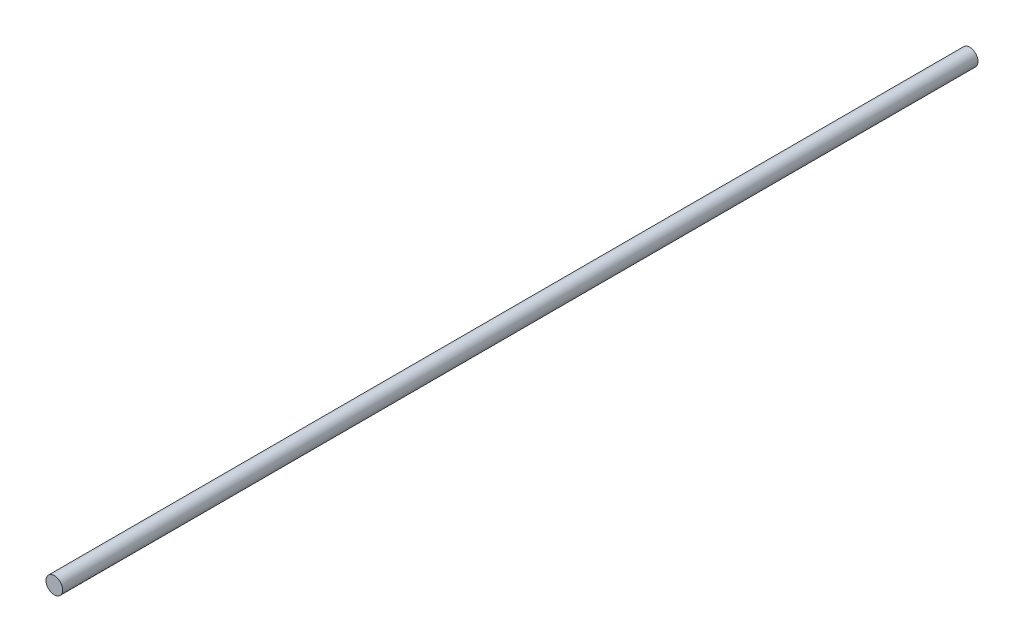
ISO-10303-21;
HEADER;
FILE_DESCRIPTION(('STEP AP214'),'2;1');
FILE_NAME('part.step','',(''),(''),'','','');
FILE_SCHEMA(('AUTOMOTIVE_DESIGN { 1 0 10303 214 1 1 1 1 }'));
ENDSEC;
DATA;
#1=APPLICATION_CONTEXT('core data for automotive mechanical design processes');
#2=APPLICATION_PROTOCOL_DEFINITION('international standard','automotive_design',2000,#1);
#3=PRODUCT_CONTEXT('',#1,'mechanical');
#4=PRODUCT('Part','Part','',(#3));
#5=PRODUCT_RELATED_PRODUCT_CATEGORY('part','',(#4));
#6=PRODUCT_DEFINITION_FORMATION('','',#4);
#7=PRODUCT_DEFINITION_CONTEXT('part definition',#1,'design');
#8=PRODUCT_DEFINITION('design','',#6,#7);
#9=PRODUCT_DEFINITION_SHAPE('','',#8);
#10=(LENGTH_UNIT() NAMED_UNIT(*) SI_UNIT(.MILLI.,.METRE.));
#11=(NAMED_UNIT(*) PLANE_ANGLE_UNIT() SI_UNIT($,.RADIAN.));
#12=(NAMED_UNIT(*) SI_UNIT($,.STERADIAN.) SOLID_ANGLE_UNIT());
#13=UNCERTAINTY_MEASURE_WITH_UNIT(LENGTH_MEASURE(1.E-05),#10,'distance_accuracy_value','');
#14=(GEOMETRIC_REPRESENTATION_CONTEXT(3) GLOBAL_UNCERTAINTY_ASSIGNED_CONTEXT((#13)) GLOBAL_UNIT_ASSIGNED_CONTEXT((#10,
#11,#12)) REPRESENTATION_CONTEXT('',''));
#15=CARTESIAN_POINT('',(0.,0.,0.));
#16=DIRECTION('',(0.,0.,1.));
#17=DIRECTION('',(1.,0.,0.));
#18=AXIS2_PLACEMENT_3D('',#15,#16,#17);
#19=CARTESIAN_POINT('',(0.,0.,-3300.));
#20=DIRECTION('',(0.,0.,1.));
#21=DIRECTION('',(1.,0.,0.));
#22=AXIS2_PLACEMENT_3D('',#19,#20,#21);
#23=CYLINDRICAL_SURFACE('',#22,30.);
#24=CARTESIAN_POINT('',(0.,0.,-3300.));
#25=DIRECTION('',(0.,0.,1.));
#26=DIRECTION('',(1.,0.,0.));
#27=AXIS2_PLACEMENT_3D('',#24,#25,#26);
#28=CIRCLE('',#27,30.);
#29=CARTESIAN_POINT('',(30.,0.,-3300.));
#30=VERTEX_POINT('',#29);
#31=EDGE_CURVE('E10',#30,#30,#28,.T.);
#32=ORIENTED_EDGE('',*,*,#31,.T.);
#33=EDGE_LOOP('',(#32));
#34=FACE_BOUND('',#33,.T.);
#35=CARTESIAN_POINT('',(0.,0.,0.));
#36=DIRECTION('',(0.,0.,1.));
#37=DIRECTION('',(1.,0.,0.));
#38=AXIS2_PLACEMENT_3D('',#35,#36,#37);
#39=CIRCLE('',#38,30.);
#40=CARTESIAN_POINT('',(30.,0.,0.));
#41=VERTEX_POINT('',#40);
#42=EDGE_CURVE('E40',#41,#41,#39,.T.);
#43=ORIENTED_EDGE('',*,*,#42,.F.);
#44=EDGE_LOOP('',(#43));
#45=FACE_BOUND('',#44,.T.);
#46=ADVANCED_FACE('F37',(#34,#45),#23,.T.);
#47=CARTESIAN_POINT('',(0.,0.,-3300.));
#48=DIRECTION('',(0.,0.,1.));
#49=DIRECTION('',(1.,0.,0.));
#50=AXIS2_PLACEMENT_3D('',#47,#48,#49);
#51=PLANE('',#50);
#52=ORIENTED_EDGE('',*,*,#31,.F.);
#53=EDGE_LOOP('',(#52));
#54=FACE_BOUND('',#53,.T.);
#55=ADVANCED_FACE('F54',(#54),#51,.F.);
#56=CARTESIAN_POINT('',(0.,0.,0.));
#57=DIRECTION('',(0.,0.,1.));
#58=DIRECTION('',(1.,0.,0.));
#59=AXIS2_PLACEMENT_3D('',#56,#57,#58);
#60=PLANE('',#59);
#61=ORIENTED_EDGE('',*,*,#42,.T.);
#62=EDGE_LOOP('',(#61));
#63=FACE_BOUND('',#62,.T.);
#64=ADVANCED_FACE('F51',(#63),#60,.T.);
#65=CLOSED_SHELL('',(#46,#55,#64));
#66=MANIFOLD_SOLID_BREP('B2',#65);
#67=ADVANCED_BREP_SHAPE_REPRESENTATION('',(#18,#66),#14);
#68=SHAPE_DEFINITION_REPRESENTATION(#9,#67);
ENDSEC;
END-ISO-10303-21;
